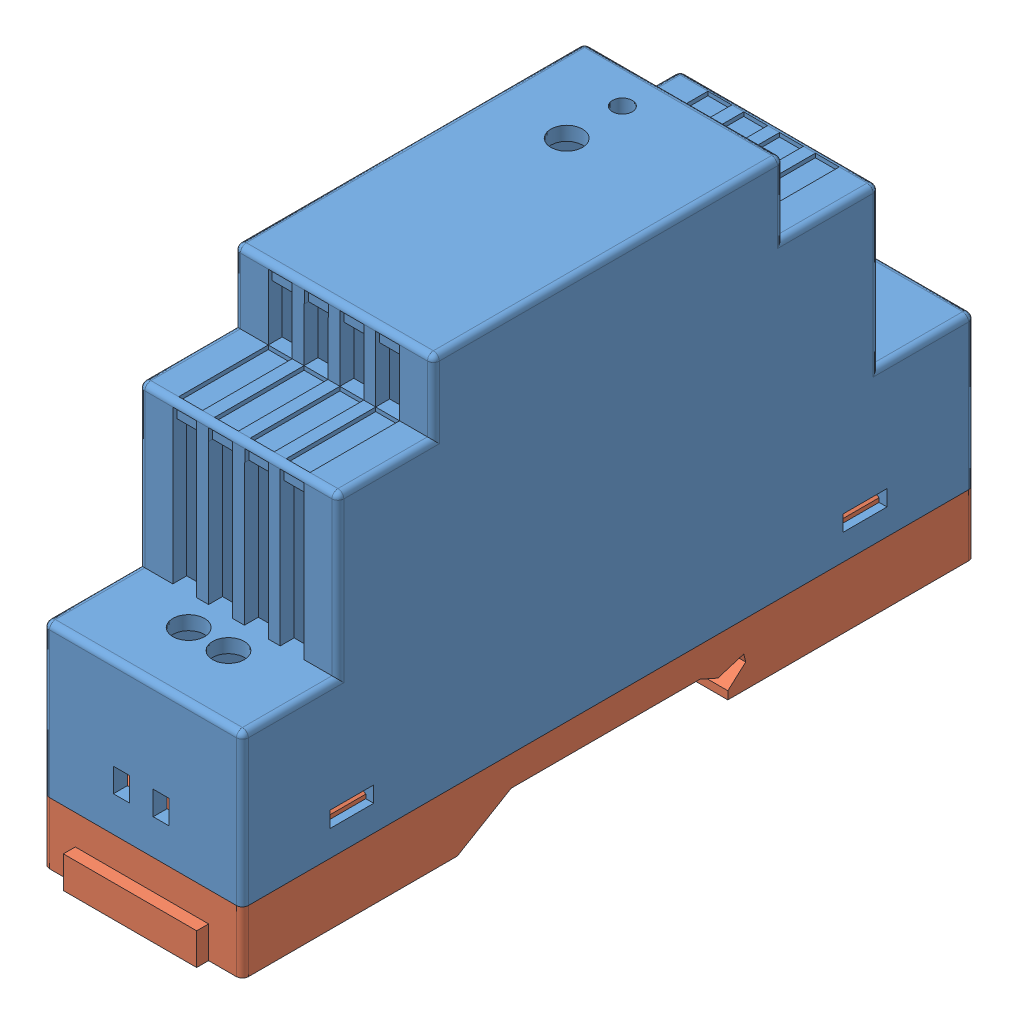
SolidWorks assembly DR-15-24 (Baugruppe).SLDASM, configuration Default (file format 12000). Lengths in mm.
Overall size (25 55.75 93.5).
2 component instances, 2 part files, 2 mates.
Components (placement in the parent):
- DR-15-24 (Oberteil)-1: DR-15-24 (Oberteil).SLDPRT [Standard] at (-22.7014 32.5089 89.6678) size (25 48 92)
- DR-15-24 (Unterteil)-1: DR-15-24 (Unterteil).SLDPRT [Default] at (-22.7014 24.7589 89.1678) size (25 12.5 93.5)
Mates (geometry in assembly coordinates):
- Deckungsgleich1: coincident aligned: line of DR-15-24 (Oberteil)-1 through (2.2986 32.5089 134.9178) axis (0 0 -1); line of DR-15-24 (Unterteil)-1 through (2.2986 32.5089 134.9178) axis (0 0 -1)
- Deckungsgleich2: coincident aligned: line of DR-15-24 (Oberteil)-1 through (1.5486 32.5089 135.6678) axis (-1 0 0); line of DR-15-24 (Unterteil)-1 through (1.5486 32.5089 135.6678) axis (-1 0 0)
